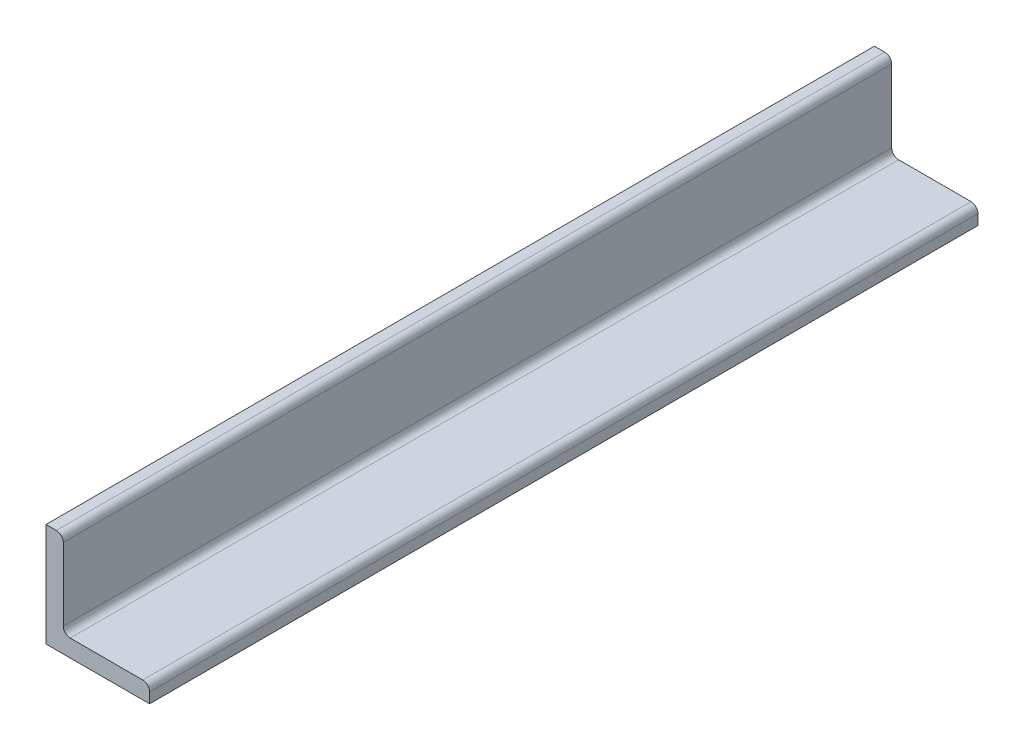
ISO-10303-21;
HEADER;
FILE_DESCRIPTION(('STEP AP214'),'2;1');
FILE_NAME('part.step','',(''),(''),'','','');
FILE_SCHEMA(('AUTOMOTIVE_DESIGN { 1 0 10303 214 1 1 1 1 }'));
ENDSEC;
DATA;
#1=APPLICATION_CONTEXT('core data for automotive mechanical design processes');
#2=APPLICATION_PROTOCOL_DEFINITION('international standard','automotive_design',2000,#1);
#3=PRODUCT_CONTEXT('',#1,'mechanical');
#4=PRODUCT('Part','Part','',(#3));
#5=PRODUCT_RELATED_PRODUCT_CATEGORY('part','',(#4));
#6=PRODUCT_DEFINITION_FORMATION('','',#4);
#7=PRODUCT_DEFINITION_CONTEXT('part definition',#1,'design');
#8=PRODUCT_DEFINITION('design','',#6,#7);
#9=PRODUCT_DEFINITION_SHAPE('','',#8);
#10=(LENGTH_UNIT() NAMED_UNIT(*) SI_UNIT(.MILLI.,.METRE.));
#11=(NAMED_UNIT(*) PLANE_ANGLE_UNIT() SI_UNIT($,.RADIAN.));
#12=(NAMED_UNIT(*) SI_UNIT($,.STERADIAN.) SOLID_ANGLE_UNIT());
#13=UNCERTAINTY_MEASURE_WITH_UNIT(LENGTH_MEASURE(1.E-05),#10,'distance_accuracy_value','');
#14=(GEOMETRIC_REPRESENTATION_CONTEXT(3) GLOBAL_UNCERTAINTY_ASSIGNED_CONTEXT((#13)) GLOBAL_UNIT_ASSIGNED_CONTEXT((#10,
#11,#12)) REPRESENTATION_CONTEXT('',''));
#15=CARTESIAN_POINT('',(0.,0.,0.));
#16=DIRECTION('',(0.,0.,1.));
#17=DIRECTION('',(1.,0.,0.));
#18=AXIS2_PLACEMENT_3D('',#15,#16,#17);
#19=CARTESIAN_POINT('',(0.,38.1,304.8));
#20=DIRECTION('',(0.,-1.,0.));
#21=DIRECTION('',(0.,0.,-1.));
#22=AXIS2_PLACEMENT_3D('',#19,#20,#21);
#23=PLANE('',#22);
#24=DIRECTION('',(-1.,0.,0.));
#25=VECTOR('',#24,1.);
#26=CARTESIAN_POINT('',(0.,38.1,304.8));
#27=LINE('',#26,#25);
#28=CARTESIAN_POINT('',(3.81,38.1,304.8));
#29=VERTEX_POINT('',#28);
#30=CARTESIAN_POINT('',(0.,38.1,304.8));
#31=VERTEX_POINT('',#30);
#32=EDGE_CURVE('E161',#29,#31,#27,.T.);
#33=ORIENTED_EDGE('',*,*,#32,.F.);
#34=DIRECTION('',(0.,0.,-1.));
#35=VECTOR('',#34,1.);
#36=CARTESIAN_POINT('',(3.81,38.1,304.8));
#37=LINE('',#36,#35);
#38=CARTESIAN_POINT('',(3.81,38.1,0.));
#39=VERTEX_POINT('',#38);
#40=EDGE_CURVE('E106',#29,#39,#37,.T.);
#41=ORIENTED_EDGE('',*,*,#40,.T.);
#42=DIRECTION('',(-1.,0.,0.));
#43=VECTOR('',#42,1.);
#44=CARTESIAN_POINT('',(0.,38.1,0.));
#45=LINE('',#44,#43);
#46=CARTESIAN_POINT('',(0.,38.1,0.));
#47=VERTEX_POINT('',#46);
#48=EDGE_CURVE('E100',#39,#47,#45,.T.);
#49=ORIENTED_EDGE('',*,*,#48,.T.);
#50=DIRECTION('',(0.,0.,-1.));
#51=VECTOR('',#50,1.);
#52=CARTESIAN_POINT('',(0.,38.1,304.8));
#53=LINE('',#52,#51);
#54=EDGE_CURVE('E104',#31,#47,#53,.T.);
#55=ORIENTED_EDGE('',*,*,#54,.F.);
#56=EDGE_LOOP('',(#33,#41,#49,#55));
#57=FACE_BOUND('',#56,.T.);
#58=ADVANCED_FACE('F29',(#57),#23,.F.);
#59=CARTESIAN_POINT('',(0.,38.1,304.8));
#60=DIRECTION('',(1.,0.,0.));
#61=DIRECTION('',(0.,1.,0.));
#62=AXIS2_PLACEMENT_3D('',#59,#60,#61);
#63=PLANE('',#62);
#64=DIRECTION('',(0.,-1.,0.));
#65=VECTOR('',#64,1.);
#66=CARTESIAN_POINT('',(0.,38.1,0.));
#67=LINE('',#66,#65);
#68=CARTESIAN_POINT('',(0.,0.,0.));
#69=VERTEX_POINT('',#68);
#70=EDGE_CURVE('E108',#47,#69,#67,.T.);
#71=ORIENTED_EDGE('',*,*,#70,.T.);
#72=DIRECTION('',(0.,0.,-1.));
#73=VECTOR('',#72,1.);
#74=CARTESIAN_POINT('',(0.,0.,304.8));
#75=LINE('',#74,#73);
#76=CARTESIAN_POINT('',(0.,0.,304.8));
#77=VERTEX_POINT('',#76);
#78=EDGE_CURVE('E120',#77,#69,#75,.T.);
#79=ORIENTED_EDGE('',*,*,#78,.F.);
#80=DIRECTION('',(0.,-1.,0.));
#81=VECTOR('',#80,1.);
#82=CARTESIAN_POINT('',(0.,38.1,304.8));
#83=LINE('',#82,#81);
#84=EDGE_CURVE('E119',#31,#77,#83,.T.);
#85=ORIENTED_EDGE('',*,*,#84,.F.);
#86=ORIENTED_EDGE('',*,*,#54,.T.);
#87=EDGE_LOOP('',(#71,#79,#85,#86));
#88=FACE_BOUND('',#87,.T.);
#89=ADVANCED_FACE('F118',(#88),#63,.F.);
#90=CARTESIAN_POINT('',(0.,0.,304.8));
#91=DIRECTION('',(0.,1.,0.));
#92=DIRECTION('',(0.,0.,1.));
#93=AXIS2_PLACEMENT_3D('',#90,#91,#92);
#94=PLANE('',#93);
#95=DIRECTION('',(1.,0.,0.));
#96=VECTOR('',#95,1.);
#97=CARTESIAN_POINT('',(0.,0.,0.));
#98=LINE('',#97,#96);
#99=CARTESIAN_POINT('',(38.1,0.,0.));
#100=VERTEX_POINT('',#99);
#101=EDGE_CURVE('E112',#69,#100,#98,.T.);
#102=ORIENTED_EDGE('',*,*,#101,.T.);
#103=DIRECTION('',(0.,0.,-1.));
#104=VECTOR('',#103,1.);
#105=CARTESIAN_POINT('',(38.1,0.,304.8));
#106=LINE('',#105,#104);
#107=CARTESIAN_POINT('',(38.1,0.,304.8));
#108=VERTEX_POINT('',#107);
#109=EDGE_CURVE('E124',#108,#100,#106,.T.);
#110=ORIENTED_EDGE('',*,*,#109,.F.);
#111=DIRECTION('',(1.,0.,0.));
#112=VECTOR('',#111,1.);
#113=CARTESIAN_POINT('',(0.,0.,304.8));
#114=LINE('',#113,#112);
#115=EDGE_CURVE('E168',#77,#108,#114,.T.);
#116=ORIENTED_EDGE('',*,*,#115,.F.);
#117=ORIENTED_EDGE('',*,*,#78,.T.);
#118=EDGE_LOOP('',(#102,#110,#116,#117));
#119=FACE_BOUND('',#118,.T.);
#120=ADVANCED_FACE('F179',(#119),#94,.F.);
#121=CARTESIAN_POINT('',(38.1,0.,304.8));
#122=DIRECTION('',(-1.,0.,0.));
#123=DIRECTION('',(0.,0.,1.));
#124=AXIS2_PLACEMENT_3D('',#121,#122,#123);
#125=PLANE('',#124);
#126=DIRECTION('',(0.,1.,0.));
#127=VECTOR('',#126,1.);
#128=CARTESIAN_POINT('',(38.1,0.,0.));
#129=LINE('',#128,#127);
#130=CARTESIAN_POINT('',(38.1,3.81,0.));
#131=VERTEX_POINT('',#130);
#132=EDGE_CURVE('E159',#100,#131,#129,.T.);
#133=ORIENTED_EDGE('',*,*,#132,.T.);
#134=DIRECTION('',(0.,0.,-1.));
#135=VECTOR('',#134,1.);
#136=CARTESIAN_POINT('',(38.1,3.81,304.8));
#137=LINE('',#136,#135);
#138=CARTESIAN_POINT('',(38.1,3.81,304.8));
#139=VERTEX_POINT('',#138);
#140=EDGE_CURVE('E36',#131,#139,#137,.F.);
#141=ORIENTED_EDGE('',*,*,#140,.T.);
#142=DIRECTION('',(0.,1.,0.));
#143=VECTOR('',#142,1.);
#144=CARTESIAN_POINT('',(38.1,0.,304.8));
#145=LINE('',#144,#143);
#146=EDGE_CURVE('E170',#108,#139,#145,.T.);
#147=ORIENTED_EDGE('',*,*,#146,.F.);
#148=ORIENTED_EDGE('',*,*,#109,.T.);
#149=EDGE_LOOP('',(#133,#141,#147,#148));
#150=FACE_BOUND('',#149,.T.);
#151=ADVANCED_FACE('F176',(#150),#125,.F.);
#152=CARTESIAN_POINT('',(6.35,6.35,304.8));
#153=DIRECTION('',(0.,-1.,0.));
#154=DIRECTION('',(1.,0.,0.));
#155=AXIS2_PLACEMENT_3D('',#152,#153,#154);
#156=PLANE('',#155);
#157=DIRECTION('',(-1.,0.,0.));
#158=VECTOR('',#157,1.);
#159=CARTESIAN_POINT('',(6.35,6.35,304.8));
#160=LINE('',#159,#158);
#161=CARTESIAN_POINT('',(35.56,6.35,304.8));
#162=VERTEX_POINT('',#161);
#163=CARTESIAN_POINT('',(8.89,6.35,304.8));
#164=VERTEX_POINT('',#163);
#165=EDGE_CURVE('E153',#162,#164,#160,.T.);
#166=ORIENTED_EDGE('',*,*,#165,.F.);
#167=DIRECTION('',(0.,0.,-1.));
#168=VECTOR('',#167,1.);
#169=CARTESIAN_POINT('',(35.56,6.35,304.8));
#170=LINE('',#169,#168);
#171=CARTESIAN_POINT('',(35.56,6.35,0.));
#172=VERTEX_POINT('',#171);
#173=EDGE_CURVE('E145',#162,#172,#170,.T.);
#174=ORIENTED_EDGE('',*,*,#173,.T.);
#175=DIRECTION('',(-1.,0.,0.));
#176=VECTOR('',#175,1.);
#177=CARTESIAN_POINT('',(6.35,6.35,0.));
#178=LINE('',#177,#176);
#179=CARTESIAN_POINT('',(8.89,6.35,0.));
#180=VERTEX_POINT('',#179);
#181=EDGE_CURVE('E152',#172,#180,#178,.T.);
#182=ORIENTED_EDGE('',*,*,#181,.T.);
#183=DIRECTION('',(0.,0.,-1.));
#184=VECTOR('',#183,1.);
#185=CARTESIAN_POINT('',(8.89,6.35,304.8));
#186=LINE('',#185,#184);
#187=EDGE_CURVE('E137',#180,#164,#186,.F.);
#188=ORIENTED_EDGE('',*,*,#187,.T.);
#189=EDGE_LOOP('',(#166,#174,#182,#188));
#190=FACE_BOUND('',#189,.T.);
#191=ADVANCED_FACE('F151',(#190),#156,.F.);
#192=CARTESIAN_POINT('',(6.35,38.1,304.8));
#193=DIRECTION('',(-1.,0.,0.));
#194=DIRECTION('',(0.,-1.,0.));
#195=AXIS2_PLACEMENT_3D('',#192,#193,#194);
#196=PLANE('',#195);
#197=DIRECTION('',(0.,1.,0.));
#198=VECTOR('',#197,1.);
#199=CARTESIAN_POINT('',(6.35,38.1,304.8));
#200=LINE('',#199,#198);
#201=CARTESIAN_POINT('',(6.35,8.89,304.8));
#202=VERTEX_POINT('',#201);
#203=CARTESIAN_POINT('',(6.35,35.56,304.8));
#204=VERTEX_POINT('',#203);
#205=EDGE_CURVE('E173',#202,#204,#200,.T.);
#206=ORIENTED_EDGE('',*,*,#205,.F.);
#207=DIRECTION('',(0.,0.,-1.));
#208=VECTOR('',#207,1.);
#209=CARTESIAN_POINT('',(6.35,8.89,0.));
#210=LINE('',#209,#208);
#211=CARTESIAN_POINT('',(6.35,8.89,0.));
#212=VERTEX_POINT('',#211);
#213=EDGE_CURVE('E134',#202,#212,#210,.T.);
#214=ORIENTED_EDGE('',*,*,#213,.T.);
#215=DIRECTION('',(0.,1.,0.));
#216=VECTOR('',#215,1.);
#217=CARTESIAN_POINT('',(6.35,38.1,0.));
#218=LINE('',#217,#216);
#219=CARTESIAN_POINT('',(6.35,35.56,0.));
#220=VERTEX_POINT('',#219);
#221=EDGE_CURVE('E158',#212,#220,#218,.T.);
#222=ORIENTED_EDGE('',*,*,#221,.T.);
#223=DIRECTION('',(0.,0.,-1.));
#224=VECTOR('',#223,1.);
#225=CARTESIAN_POINT('',(6.35,35.56,304.8));
#226=LINE('',#225,#224);
#227=EDGE_CURVE('E129',#220,#204,#226,.F.);
#228=ORIENTED_EDGE('',*,*,#227,.T.);
#229=EDGE_LOOP('',(#206,#214,#222,#228));
#230=FACE_BOUND('',#229,.T.);
#231=ADVANCED_FACE('F188',(#230),#196,.F.);
#232=CARTESIAN_POINT('',(38.1,38.1,304.8));
#233=DIRECTION('',(0.,0.,1.));
#234=DIRECTION('',(1.,0.,0.));
#235=AXIS2_PLACEMENT_3D('',#232,#233,#234);
#236=PLANE('',#235);
#237=ORIENTED_EDGE('',*,*,#146,.T.);
#238=CARTESIAN_POINT('',(35.56,3.81,304.8));
#239=DIRECTION('',(0.,0.,1.));
#240=DIRECTION('',(1.,0.,0.));
#241=AXIS2_PLACEMENT_3D('',#238,#239,#240);
#242=CIRCLE('',#241,2.54);
#243=EDGE_CURVE('E11',#139,#162,#242,.T.);
#244=ORIENTED_EDGE('',*,*,#243,.T.);
#245=ORIENTED_EDGE('',*,*,#165,.T.);
#246=CARTESIAN_POINT('',(8.89,8.89,304.8));
#247=DIRECTION('',(0.,0.,1.));
#248=DIRECTION('',(1.,0.,0.));
#249=AXIS2_PLACEMENT_3D('',#246,#247,#248);
#250=CIRCLE('',#249,2.54);
#251=EDGE_CURVE('E143',#164,#202,#250,.F.);
#252=ORIENTED_EDGE('',*,*,#251,.T.);
#253=ORIENTED_EDGE('',*,*,#205,.T.);
#254=CARTESIAN_POINT('',(3.81,35.56,304.8));
#255=DIRECTION('',(0.,0.,1.));
#256=DIRECTION('',(1.,0.,0.));
#257=AXIS2_PLACEMENT_3D('',#254,#255,#256);
#258=CIRCLE('',#257,2.54);
#259=EDGE_CURVE('E132',#204,#29,#258,.T.);
#260=ORIENTED_EDGE('',*,*,#259,.T.);
#261=ORIENTED_EDGE('',*,*,#32,.T.);
#262=ORIENTED_EDGE('',*,*,#84,.T.);
#263=ORIENTED_EDGE('',*,*,#115,.T.);
#264=EDGE_LOOP('',(#237,#244,#245,#252,#253,#260,#261,#262,#263));
#265=FACE_BOUND('',#264,.T.);
#266=ADVANCED_FACE('F181',(#265),#236,.T.);
#267=CARTESIAN_POINT('',(38.1,38.1,0.));
#268=DIRECTION('',(0.,0.,1.));
#269=DIRECTION('',(1.,0.,0.));
#270=AXIS2_PLACEMENT_3D('',#267,#268,#269);
#271=PLANE('',#270);
#272=ORIENTED_EDGE('',*,*,#181,.F.);
#273=CARTESIAN_POINT('',(35.56,3.81,0.));
#274=DIRECTION('',(0.,0.,1.));
#275=DIRECTION('',(1.,0.,0.));
#276=AXIS2_PLACEMENT_3D('',#273,#274,#275);
#277=CIRCLE('',#276,2.54);
#278=EDGE_CURVE('E50',#172,#131,#277,.F.);
#279=ORIENTED_EDGE('',*,*,#278,.T.);
#280=ORIENTED_EDGE('',*,*,#132,.F.);
#281=ORIENTED_EDGE('',*,*,#101,.F.);
#282=ORIENTED_EDGE('',*,*,#70,.F.);
#283=ORIENTED_EDGE('',*,*,#48,.F.);
#284=CARTESIAN_POINT('',(3.81,35.56,0.));
#285=DIRECTION('',(0.,0.,1.));
#286=DIRECTION('',(1.,0.,0.));
#287=AXIS2_PLACEMENT_3D('',#284,#285,#286);
#288=CIRCLE('',#287,2.54);
#289=EDGE_CURVE('E122',#39,#220,#288,.F.);
#290=ORIENTED_EDGE('',*,*,#289,.T.);
#291=ORIENTED_EDGE('',*,*,#221,.F.);
#292=CARTESIAN_POINT('',(8.89,8.89,0.));
#293=DIRECTION('',(0.,0.,1.));
#294=DIRECTION('',(1.,0.,0.));
#295=AXIS2_PLACEMENT_3D('',#292,#293,#294);
#296=CIRCLE('',#295,2.54);
#297=EDGE_CURVE('E140',#212,#180,#296,.T.);
#298=ORIENTED_EDGE('',*,*,#297,.T.);
#299=EDGE_LOOP('',(#272,#279,#280,#281,#282,#283,#290,#291,#298));
#300=FACE_BOUND('',#299,.T.);
#301=ADVANCED_FACE('F111',(#300),#271,.F.);
#302=CARTESIAN_POINT('',(3.81,35.56,304.8));
#303=DIRECTION('',(0.,0.,-1.));
#304=DIRECTION('',(-1.,0.,0.));
#305=AXIS2_PLACEMENT_3D('',#302,#303,#304);
#306=CYLINDRICAL_SURFACE('',#305,2.54);
#307=ORIENTED_EDGE('',*,*,#259,.F.);
#308=ORIENTED_EDGE('',*,*,#227,.F.);
#309=ORIENTED_EDGE('',*,*,#289,.F.);
#310=ORIENTED_EDGE('',*,*,#40,.F.);
#311=EDGE_LOOP('',(#307,#308,#309,#310));
#312=FACE_BOUND('',#311,.T.);
#313=ADVANCED_FACE('F184',(#312),#306,.T.);
#314=CARTESIAN_POINT('',(8.89,8.89,304.8));
#315=DIRECTION('',(0.,0.,1.));
#316=DIRECTION('',(1.,0.,0.));
#317=AXIS2_PLACEMENT_3D('',#314,#315,#316);
#318=CYLINDRICAL_SURFACE('',#317,2.54);
#319=ORIENTED_EDGE('',*,*,#251,.F.);
#320=ORIENTED_EDGE('',*,*,#187,.F.);
#321=ORIENTED_EDGE('',*,*,#297,.F.);
#322=ORIENTED_EDGE('',*,*,#213,.F.);
#323=EDGE_LOOP('',(#319,#320,#321,#322));
#324=FACE_BOUND('',#323,.T.);
#325=ADVANCED_FACE('F192',(#324),#318,.F.);
#326=CARTESIAN_POINT('',(35.56,3.81,304.8));
#327=DIRECTION('',(0.,0.,-1.));
#328=DIRECTION('',(-1.,0.,0.));
#329=AXIS2_PLACEMENT_3D('',#326,#327,#328);
#330=CYLINDRICAL_SURFACE('',#329,2.54);
#331=ORIENTED_EDGE('',*,*,#243,.F.);
#332=ORIENTED_EDGE('',*,*,#140,.F.);
#333=ORIENTED_EDGE('',*,*,#278,.F.);
#334=ORIENTED_EDGE('',*,*,#173,.F.);
#335=EDGE_LOOP('',(#331,#332,#333,#334));
#336=FACE_BOUND('',#335,.T.);
#337=ADVANCED_FACE('F193',(#336),#330,.T.);
#338=CLOSED_SHELL('',(#58,#89,#120,#151,#191,#231,#266,#301,#313,#325,#337));
#339=MANIFOLD_SOLID_BREP('B2',#338);
#340=ADVANCED_BREP_SHAPE_REPRESENTATION('',(#18,#339),#14);
#341=SHAPE_DEFINITION_REPRESENTATION(#9,#340);
ENDSEC;
END-ISO-10303-21;
